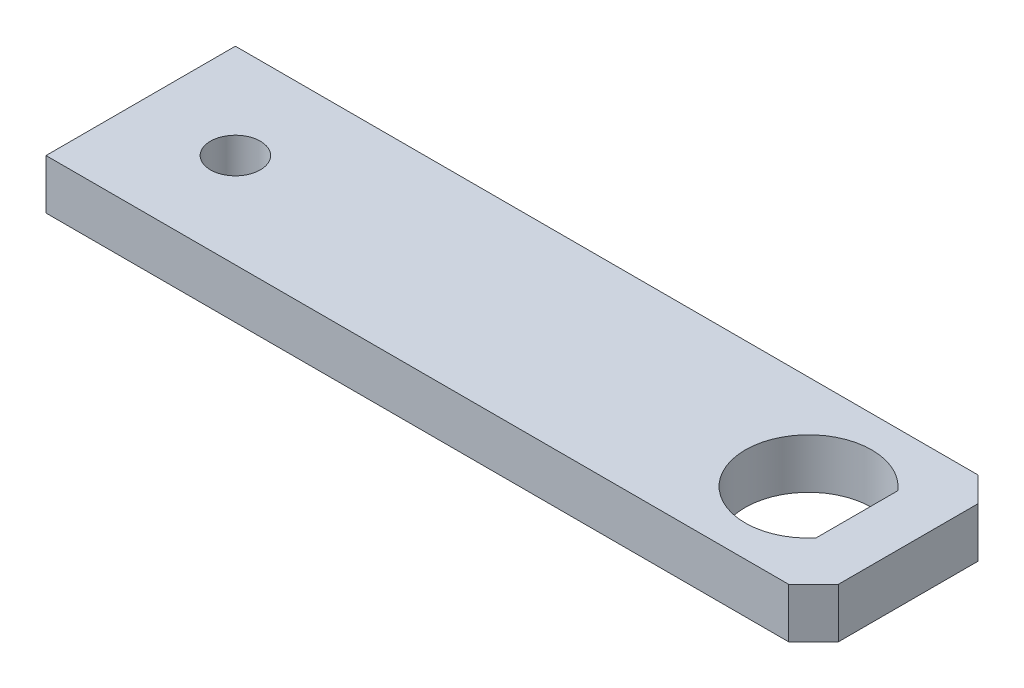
ISO-10303-21;
HEADER;
FILE_DESCRIPTION(('STEP AP214'),'2;1');
FILE_NAME('part.step','',(''),(''),'','','');
FILE_SCHEMA(('AUTOMOTIVE_DESIGN { 1 0 10303 214 1 1 1 1 }'));
ENDSEC;
DATA;
#1=APPLICATION_CONTEXT('core data for automotive mechanical design processes');
#2=APPLICATION_PROTOCOL_DEFINITION('international standard','automotive_design',2000,#1);
#3=PRODUCT_CONTEXT('',#1,'mechanical');
#4=PRODUCT('Part','Part','',(#3));
#5=PRODUCT_RELATED_PRODUCT_CATEGORY('part','',(#4));
#6=PRODUCT_DEFINITION_FORMATION('','',#4);
#7=PRODUCT_DEFINITION_CONTEXT('part definition',#1,'design');
#8=PRODUCT_DEFINITION('design','',#6,#7);
#9=PRODUCT_DEFINITION_SHAPE('','',#8);
#10=(LENGTH_UNIT() NAMED_UNIT(*) SI_UNIT(.MILLI.,.METRE.));
#11=(NAMED_UNIT(*) PLANE_ANGLE_UNIT() SI_UNIT($,.RADIAN.));
#12=(NAMED_UNIT(*) SI_UNIT($,.STERADIAN.) SOLID_ANGLE_UNIT());
#13=UNCERTAINTY_MEASURE_WITH_UNIT(LENGTH_MEASURE(1.E-05),#10,'distance_accuracy_value','');
#14=(GEOMETRIC_REPRESENTATION_CONTEXT(3) GLOBAL_UNCERTAINTY_ASSIGNED_CONTEXT((#13)) GLOBAL_UNIT_ASSIGNED_CONTEXT((#10,
#11,#12)) REPRESENTATION_CONTEXT('',''));
#15=CARTESIAN_POINT('',(0.,0.,0.));
#16=DIRECTION('',(0.,0.,1.));
#17=DIRECTION('',(1.,0.,0.));
#18=AXIS2_PLACEMENT_3D('',#15,#16,#17);
#19=CARTESIAN_POINT('',(74.5,5.00000000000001,0.));
#20=DIRECTION('',(0.707106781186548,0.,-0.707106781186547));
#21=DIRECTION('',(-0.707106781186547,0.,-0.707106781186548));
#22=AXIS2_PLACEMENT_3D('',#19,#20,#21);
#23=PLANE('',#22);
#24=DIRECTION('',(0.707106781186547,0.,0.707106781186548));
#25=VECTOR('',#24,1.);
#26=CARTESIAN_POINT('',(74.5,0.,0.));
#27=LINE('',#26,#25);
#28=CARTESIAN_POINT('',(74.5,0.,0.));
#29=VERTEX_POINT('',#28);
#30=CARTESIAN_POINT('',(77.,0.,2.50000000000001));
#31=VERTEX_POINT('',#30);
#32=EDGE_CURVE('E118',#29,#31,#27,.T.);
#33=ORIENTED_EDGE('',*,*,#32,.F.);
#34=DIRECTION('',(0.,-1.,0.));
#35=VECTOR('',#34,1.);
#36=CARTESIAN_POINT('',(74.5,5.00000000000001,0.));
#37=LINE('',#36,#35);
#38=CARTESIAN_POINT('',(74.5,5.00000000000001,0.));
#39=VERTEX_POINT('',#38);
#40=EDGE_CURVE('E11',#39,#29,#37,.T.);
#41=ORIENTED_EDGE('',*,*,#40,.F.);
#42=DIRECTION('',(0.707106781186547,0.,0.707106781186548));
#43=VECTOR('',#42,1.);
#44=CARTESIAN_POINT('',(74.5,5.00000000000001,0.));
#45=LINE('',#44,#43);
#46=CARTESIAN_POINT('',(77.,5.00000000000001,2.50000000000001));
#47=VERTEX_POINT('',#46);
#48=EDGE_CURVE('E121',#39,#47,#45,.T.);
#49=ORIENTED_EDGE('',*,*,#48,.T.);
#50=DIRECTION('',(0.,-1.,0.));
#51=VECTOR('',#50,1.);
#52=CARTESIAN_POINT('',(77.,5.00000000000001,2.50000000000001));
#53=LINE('',#52,#51);
#54=EDGE_CURVE('E35',#47,#31,#53,.T.);
#55=ORIENTED_EDGE('',*,*,#54,.T.);
#56=EDGE_LOOP('',(#33,#41,#49,#55));
#57=FACE_BOUND('',#56,.T.);
#58=ADVANCED_FACE('F32',(#57),#23,.T.);
#59=CARTESIAN_POINT('',(0.,5.00000000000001,0.));
#60=DIRECTION('',(0.,0.,-1.));
#61=DIRECTION('',(-1.,0.,0.));
#62=AXIS2_PLACEMENT_3D('',#59,#60,#61);
#63=PLANE('',#62);
#64=DIRECTION('',(1.,0.,0.));
#65=VECTOR('',#64,1.);
#66=CARTESIAN_POINT('',(0.,0.,0.));
#67=LINE('',#66,#65);
#68=CARTESIAN_POINT('',(0.,0.,0.));
#69=VERTEX_POINT('',#68);
#70=EDGE_CURVE('E125',#69,#29,#67,.T.);
#71=ORIENTED_EDGE('',*,*,#70,.F.);
#72=DIRECTION('',(0.,-1.,0.));
#73=VECTOR('',#72,1.);
#74=CARTESIAN_POINT('',(0.,5.00000000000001,0.));
#75=LINE('',#74,#73);
#76=CARTESIAN_POINT('',(0.,5.00000000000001,0.));
#77=VERTEX_POINT('',#76);
#78=EDGE_CURVE('E40',#77,#69,#75,.T.);
#79=ORIENTED_EDGE('',*,*,#78,.F.);
#80=DIRECTION('',(1.,0.,0.));
#81=VECTOR('',#80,1.);
#82=CARTESIAN_POINT('',(0.,5.00000000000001,0.));
#83=LINE('',#82,#81);
#84=EDGE_CURVE('E137',#77,#39,#83,.T.);
#85=ORIENTED_EDGE('',*,*,#84,.T.);
#86=ORIENTED_EDGE('',*,*,#40,.T.);
#87=EDGE_LOOP('',(#71,#79,#85,#86));
#88=FACE_BOUND('',#87,.T.);
#89=ADVANCED_FACE('F174',(#88),#63,.T.);
#90=CARTESIAN_POINT('',(0.,5.00000000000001,19.));
#91=DIRECTION('',(-1.,0.,0.));
#92=DIRECTION('',(0.,0.,1.));
#93=AXIS2_PLACEMENT_3D('',#90,#91,#92);
#94=PLANE('',#93);
#95=DIRECTION('',(0.,0.,-1.));
#96=VECTOR('',#95,1.);
#97=CARTESIAN_POINT('',(0.,0.,19.));
#98=LINE('',#97,#96);
#99=CARTESIAN_POINT('',(0.,0.,19.));
#100=VERTEX_POINT('',#99);
#101=EDGE_CURVE('E151',#100,#69,#98,.T.);
#102=ORIENTED_EDGE('',*,*,#101,.F.);
#103=DIRECTION('',(0.,-1.,0.));
#104=VECTOR('',#103,1.);
#105=CARTESIAN_POINT('',(0.,5.00000000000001,19.));
#106=LINE('',#105,#104);
#107=CARTESIAN_POINT('',(0.,5.00000000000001,19.));
#108=VERTEX_POINT('',#107);
#109=EDGE_CURVE('E157',#108,#100,#106,.T.);
#110=ORIENTED_EDGE('',*,*,#109,.F.);
#111=DIRECTION('',(0.,0.,-1.));
#112=VECTOR('',#111,1.);
#113=CARTESIAN_POINT('',(0.,5.00000000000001,19.));
#114=LINE('',#113,#112);
#115=EDGE_CURVE('E134',#108,#77,#114,.T.);
#116=ORIENTED_EDGE('',*,*,#115,.T.);
#117=ORIENTED_EDGE('',*,*,#78,.T.);
#118=EDGE_LOOP('',(#102,#110,#116,#117));
#119=FACE_BOUND('',#118,.T.);
#120=ADVANCED_FACE('F186',(#119),#94,.T.);
#121=CARTESIAN_POINT('',(74.5,5.00000000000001,19.));
#122=DIRECTION('',(0.,0.,1.));
#123=DIRECTION('',(1.,0.,0.));
#124=AXIS2_PLACEMENT_3D('',#121,#122,#123);
#125=PLANE('',#124);
#126=DIRECTION('',(-1.,0.,0.));
#127=VECTOR('',#126,1.);
#128=CARTESIAN_POINT('',(74.5,0.,19.));
#129=LINE('',#128,#127);
#130=CARTESIAN_POINT('',(74.5,0.,19.));
#131=VERTEX_POINT('',#130);
#132=EDGE_CURVE('E148',#131,#100,#129,.T.);
#133=ORIENTED_EDGE('',*,*,#132,.F.);
#134=DIRECTION('',(0.,-1.,0.));
#135=VECTOR('',#134,1.);
#136=CARTESIAN_POINT('',(74.5,5.00000000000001,19.));
#137=LINE('',#136,#135);
#138=CARTESIAN_POINT('',(74.5,5.00000000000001,19.));
#139=VERTEX_POINT('',#138);
#140=EDGE_CURVE('E159',#139,#131,#137,.T.);
#141=ORIENTED_EDGE('',*,*,#140,.F.);
#142=DIRECTION('',(-1.,0.,0.));
#143=VECTOR('',#142,1.);
#144=CARTESIAN_POINT('',(74.5,5.00000000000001,19.));
#145=LINE('',#144,#143);
#146=EDGE_CURVE('E131',#139,#108,#145,.T.);
#147=ORIENTED_EDGE('',*,*,#146,.T.);
#148=ORIENTED_EDGE('',*,*,#109,.T.);
#149=EDGE_LOOP('',(#133,#141,#147,#148));
#150=FACE_BOUND('',#149,.T.);
#151=ADVANCED_FACE('F184',(#150),#125,.T.);
#152=CARTESIAN_POINT('',(77.,5.00000000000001,16.5));
#153=DIRECTION('',(0.707106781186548,0.,0.707106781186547));
#154=DIRECTION('',(0.707106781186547,0.,-0.707106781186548));
#155=AXIS2_PLACEMENT_3D('',#152,#153,#154);
#156=PLANE('',#155);
#157=DIRECTION('',(-0.707106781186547,0.,0.707106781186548));
#158=VECTOR('',#157,1.);
#159=CARTESIAN_POINT('',(77.,0.,16.5));
#160=LINE('',#159,#158);
#161=CARTESIAN_POINT('',(77.,0.,16.5));
#162=VERTEX_POINT('',#161);
#163=EDGE_CURVE('E145',#162,#131,#160,.T.);
#164=ORIENTED_EDGE('',*,*,#163,.F.);
#165=DIRECTION('',(0.,-1.,0.));
#166=VECTOR('',#165,1.);
#167=CARTESIAN_POINT('',(77.,5.00000000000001,16.5));
#168=LINE('',#167,#166);
#169=CARTESIAN_POINT('',(77.,5.00000000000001,16.5));
#170=VERTEX_POINT('',#169);
#171=EDGE_CURVE('E160',#170,#162,#168,.T.);
#172=ORIENTED_EDGE('',*,*,#171,.F.);
#173=DIRECTION('',(-0.707106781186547,0.,0.707106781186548));
#174=VECTOR('',#173,1.);
#175=CARTESIAN_POINT('',(77.,5.00000000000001,16.5));
#176=LINE('',#175,#174);
#177=EDGE_CURVE('E128',#170,#139,#176,.T.);
#178=ORIENTED_EDGE('',*,*,#177,.T.);
#179=ORIENTED_EDGE('',*,*,#140,.T.);
#180=EDGE_LOOP('',(#164,#172,#178,#179));
#181=FACE_BOUND('',#180,.T.);
#182=ADVANCED_FACE('F181',(#181),#156,.T.);
#183=CARTESIAN_POINT('',(77.,5.00000000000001,2.50000000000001));
#184=DIRECTION('',(1.,0.,0.));
#185=DIRECTION('',(0.,0.,-1.));
#186=AXIS2_PLACEMENT_3D('',#183,#184,#185);
#187=PLANE('',#186);
#188=DIRECTION('',(0.,0.,1.));
#189=VECTOR('',#188,1.);
#190=CARTESIAN_POINT('',(77.,0.,2.50000000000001));
#191=LINE('',#190,#189);
#192=EDGE_CURVE('E142',#31,#162,#191,.T.);
#193=ORIENTED_EDGE('',*,*,#192,.F.);
#194=ORIENTED_EDGE('',*,*,#54,.F.);
#195=DIRECTION('',(0.,0.,1.));
#196=VECTOR('',#195,1.);
#197=CARTESIAN_POINT('',(77.,5.00000000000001,2.50000000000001));
#198=LINE('',#197,#196);
#199=EDGE_CURVE('E124',#47,#170,#198,.T.);
#200=ORIENTED_EDGE('',*,*,#199,.T.);
#201=ORIENTED_EDGE('',*,*,#171,.T.);
#202=EDGE_LOOP('',(#193,#194,#200,#201));
#203=FACE_BOUND('',#202,.T.);
#204=ADVANCED_FACE('F168',(#203),#187,.T.);
#205=CARTESIAN_POINT('',(84.,5.00000000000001,9.5));
#206=DIRECTION('',(0.,-1.,0.));
#207=DIRECTION('',(0.,0.,-1.));
#208=AXIS2_PLACEMENT_3D('',#205,#206,#207);
#209=PLANE('',#208);
#210=DIRECTION('',(0.,0.,1.));
#211=VECTOR('',#210,1.);
#212=CARTESIAN_POINT('',(71.85,5.00000000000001,13.5987803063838));
#213=LINE('',#212,#211);
#214=CARTESIAN_POINT('',(71.85,5.00000000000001,5.40121969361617));
#215=VERTEX_POINT('',#214);
#216=CARTESIAN_POINT('',(71.85,5.00000000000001,13.5987803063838));
#217=VERTEX_POINT('',#216);
#218=EDGE_CURVE('E100',#215,#217,#213,.T.);
#219=ORIENTED_EDGE('',*,*,#218,.T.);
#220=CARTESIAN_POINT('',(67.,5.00000000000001,9.5));
#221=DIRECTION('',(0.,-1.,0.));
#222=DIRECTION('',(0.,0.,1.));
#223=AXIS2_PLACEMENT_3D('',#220,#221,#222);
#224=CIRCLE('',#223,6.35);
#225=EDGE_CURVE('E48',#217,#215,#224,.T.);
#226=ORIENTED_EDGE('',*,*,#225,.T.);
#227=EDGE_LOOP('',(#219,#226));
#228=FACE_BOUND('',#227,.T.);
#229=CARTESIAN_POINT('',(9.5,5.00000000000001,9.5));
#230=DIRECTION('',(0.,-1.,0.));
#231=DIRECTION('',(0.,0.,1.));
#232=AXIS2_PLACEMENT_3D('',#229,#230,#231);
#233=CIRCLE('',#232,2.5);
#234=CARTESIAN_POINT('',(9.5,5.00000000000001,12.));
#235=VERTEX_POINT('',#234);
#236=EDGE_CURVE('E115',#235,#235,#233,.T.);
#237=ORIENTED_EDGE('',*,*,#236,.T.);
#238=EDGE_LOOP('',(#237));
#239=FACE_BOUND('',#238,.T.);
#240=ORIENTED_EDGE('',*,*,#48,.F.);
#241=ORIENTED_EDGE('',*,*,#84,.F.);
#242=ORIENTED_EDGE('',*,*,#115,.F.);
#243=ORIENTED_EDGE('',*,*,#146,.F.);
#244=ORIENTED_EDGE('',*,*,#177,.F.);
#245=ORIENTED_EDGE('',*,*,#199,.F.);
#246=EDGE_LOOP('',(#240,#241,#242,#243,#244,#245));
#247=FACE_BOUND('',#246,.T.);
#248=ADVANCED_FACE('F106',(#228,#239,#247),#209,.F.);
#249=CARTESIAN_POINT('',(84.,0.,9.5));
#250=DIRECTION('',(0.,-1.,0.));
#251=DIRECTION('',(0.,0.,-1.));
#252=AXIS2_PLACEMENT_3D('',#249,#250,#251);
#253=PLANE('',#252);
#254=CARTESIAN_POINT('',(67.,0.,9.5));
#255=DIRECTION('',(0.,-1.,0.));
#256=DIRECTION('',(0.,0.,1.));
#257=AXIS2_PLACEMENT_3D('',#254,#255,#256);
#258=CIRCLE('',#257,6.35);
#259=CARTESIAN_POINT('',(71.85,0.,13.5987803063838));
#260=VERTEX_POINT('',#259);
#261=CARTESIAN_POINT('',(71.85,0.,5.40121969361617));
#262=VERTEX_POINT('',#261);
#263=EDGE_CURVE('E53',#260,#262,#258,.T.);
#264=ORIENTED_EDGE('',*,*,#263,.F.);
#265=DIRECTION('',(0.,0.,1.));
#266=VECTOR('',#265,1.);
#267=CARTESIAN_POINT('',(71.85,0.,13.5987803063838));
#268=LINE('',#267,#266);
#269=EDGE_CURVE('E108',#262,#260,#268,.T.);
#270=ORIENTED_EDGE('',*,*,#269,.F.);
#271=EDGE_LOOP('',(#264,#270));
#272=FACE_BOUND('',#271,.T.);
#273=CARTESIAN_POINT('',(9.5,0.,9.5));
#274=DIRECTION('',(0.,-1.,0.));
#275=DIRECTION('',(0.,0.,1.));
#276=AXIS2_PLACEMENT_3D('',#273,#274,#275);
#277=CIRCLE('',#276,2.5);
#278=CARTESIAN_POINT('',(9.5,0.,12.));
#279=VERTEX_POINT('',#278);
#280=EDGE_CURVE('E113',#279,#279,#277,.T.);
#281=ORIENTED_EDGE('',*,*,#280,.F.);
#282=EDGE_LOOP('',(#281));
#283=FACE_BOUND('',#282,.T.);
#284=ORIENTED_EDGE('',*,*,#32,.T.);
#285=ORIENTED_EDGE('',*,*,#192,.T.);
#286=ORIENTED_EDGE('',*,*,#163,.T.);
#287=ORIENTED_EDGE('',*,*,#132,.T.);
#288=ORIENTED_EDGE('',*,*,#101,.T.);
#289=ORIENTED_EDGE('',*,*,#70,.T.);
#290=EDGE_LOOP('',(#284,#285,#286,#287,#288,#289));
#291=FACE_BOUND('',#290,.T.);
#292=ADVANCED_FACE('F170',(#272,#283,#291),#253,.T.);
#293=CARTESIAN_POINT('',(9.5,5.00000000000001,9.5));
#294=DIRECTION('',(0.,-1.,0.));
#295=DIRECTION('',(0.,0.,-1.));
#296=AXIS2_PLACEMENT_3D('',#293,#294,#295);
#297=CYLINDRICAL_SURFACE('',#296,2.5);
#298=ORIENTED_EDGE('',*,*,#236,.F.);
#299=EDGE_LOOP('',(#298));
#300=FACE_BOUND('',#299,.T.);
#301=ORIENTED_EDGE('',*,*,#280,.T.);
#302=EDGE_LOOP('',(#301));
#303=FACE_BOUND('',#302,.T.);
#304=ADVANCED_FACE('F244',(#300,#303),#297,.F.);
#305=CARTESIAN_POINT('',(67.,5.00000000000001,9.5));
#306=DIRECTION('',(0.,-1.,0.));
#307=DIRECTION('',(0.,0.,-1.));
#308=AXIS2_PLACEMENT_3D('',#305,#306,#307);
#309=CYLINDRICAL_SURFACE('',#308,6.35);
#310=ORIENTED_EDGE('',*,*,#263,.T.);
#311=DIRECTION('',(0.,-1.,0.));
#312=VECTOR('',#311,1.);
#313=CARTESIAN_POINT('',(71.85,5.00000000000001,5.40121969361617));
#314=LINE('',#313,#312);
#315=EDGE_CURVE('E93',#215,#262,#314,.T.);
#316=ORIENTED_EDGE('',*,*,#315,.F.);
#317=ORIENTED_EDGE('',*,*,#225,.F.);
#318=DIRECTION('',(0.,-1.,0.));
#319=VECTOR('',#318,1.);
#320=CARTESIAN_POINT('',(71.85,5.00000000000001,13.5987803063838));
#321=LINE('',#320,#319);
#322=EDGE_CURVE('E99',#217,#260,#321,.T.);
#323=ORIENTED_EDGE('',*,*,#322,.T.);
#324=EDGE_LOOP('',(#310,#316,#317,#323));
#325=FACE_BOUND('',#324,.T.);
#326=ADVANCED_FACE('F95',(#325),#309,.F.);
#327=CARTESIAN_POINT('',(71.85,5.00000000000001,13.5987803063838));
#328=DIRECTION('',(1.,0.,0.));
#329=DIRECTION('',(0.,0.,-1.));
#330=AXIS2_PLACEMENT_3D('',#327,#328,#329);
#331=PLANE('',#330);
#332=ORIENTED_EDGE('',*,*,#269,.T.);
#333=ORIENTED_EDGE('',*,*,#322,.F.);
#334=ORIENTED_EDGE('',*,*,#218,.F.);
#335=ORIENTED_EDGE('',*,*,#315,.T.);
#336=EDGE_LOOP('',(#332,#333,#334,#335));
#337=FACE_BOUND('',#336,.T.);
#338=ADVANCED_FACE('F103',(#337),#331,.F.);
#339=CLOSED_SHELL('',(#58,#89,#120,#151,#182,#204,#248,#292,#304,#326,#338));
#340=MANIFOLD_SOLID_BREP('B2',#339);
#341=ADVANCED_BREP_SHAPE_REPRESENTATION('',(#18,#340),#14);
#342=SHAPE_DEFINITION_REPRESENTATION(#9,#341);
ENDSEC;
END-ISO-10303-21;
